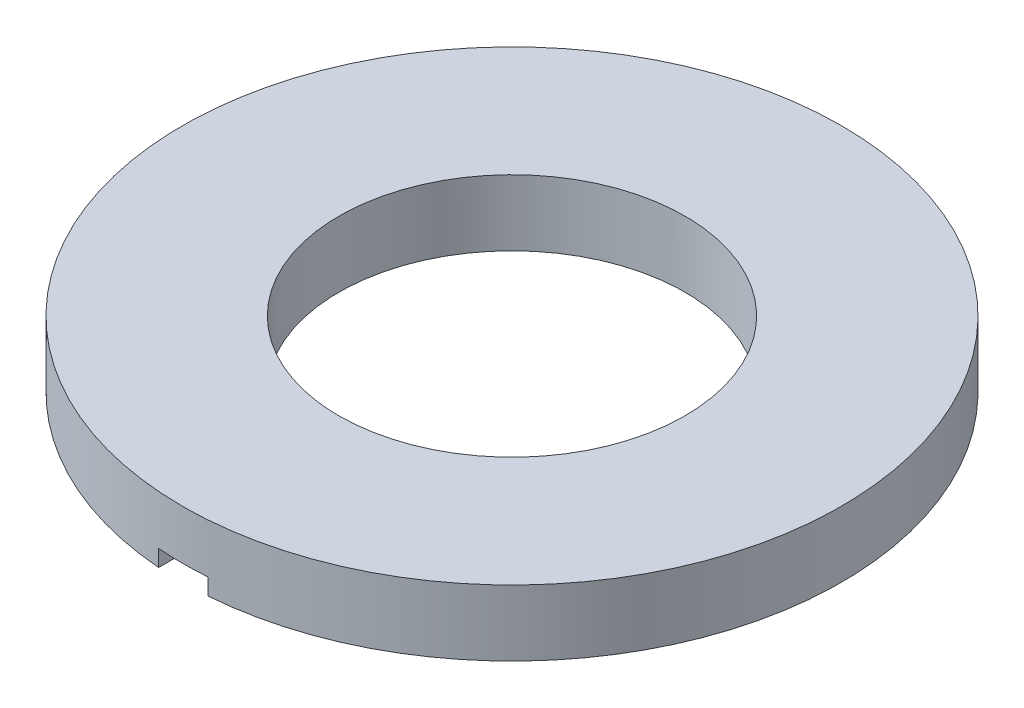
from build123d import *

# Parameters (mm, degrees)
SKETCH1_R          = 10
SKETCH1_R_2        = 5.25
EXTRUDE1_DEPTH     = 2
SKETCH2_W          = 1.5
SKETCH2_H          = 9.5
CUT_EXTRUDE1_DEPTH = 0.5


with BuildPart() as part:
    # Sketch1 → Extrude1 (new body)
    with BuildSketch(Plane(origin=(0, 0, 0), x_dir=(1, 0, 0), z_dir=(0, 1, 0))):
        with Locations(Location((0, 0, 0), (0, 0, 270))):
            Circle(SKETCH1_R)
        with Locations(Location((0, 0, 0), (0, 0, 270))):
            Circle(SKETCH1_R_2, mode=Mode.SUBTRACT)
    extrude(amount=EXTRUDE1_DEPTH)

    # Sketch2 → Cut-Extrude1 (cut)
    with BuildSketch(Plane.XZ):
        with Locations((0, 5.25)):
            Rectangle(SKETCH2_W, SKETCH2_H)
    extrude(amount=-CUT_EXTRUDE1_DEPTH, mode=Mode.SUBTRACT)


solid = part.part
